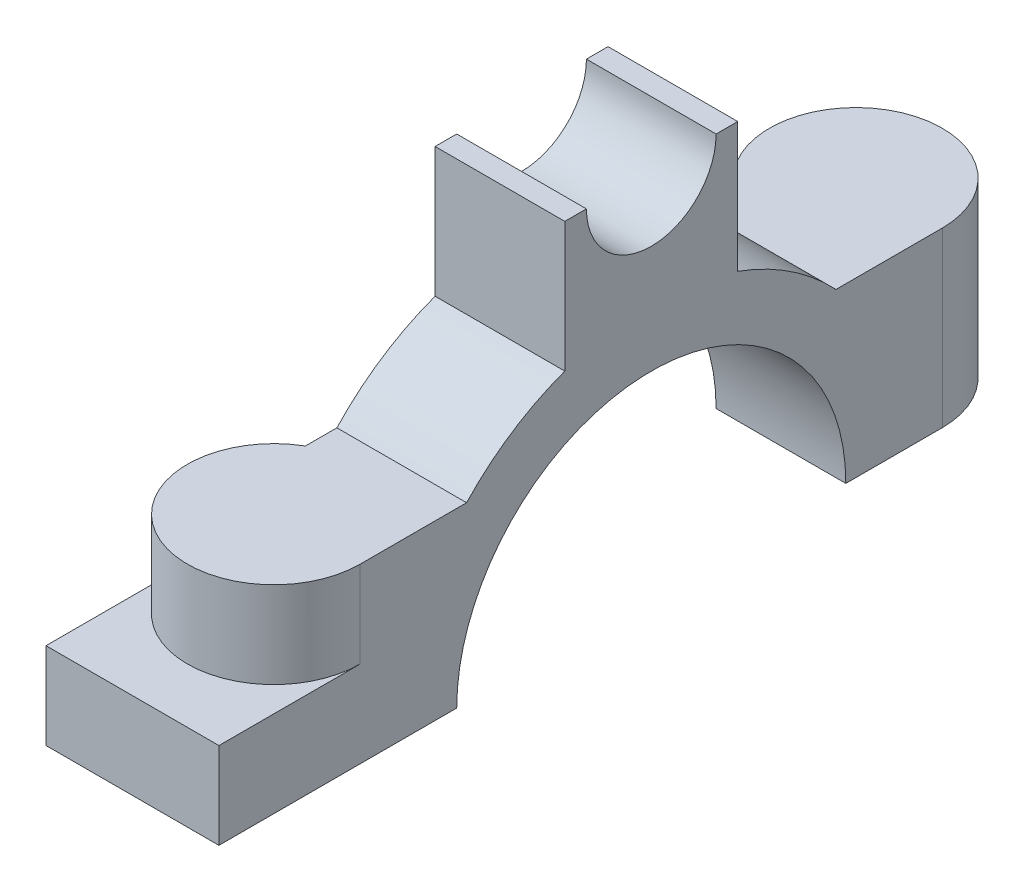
ISO-10303-21;
HEADER;
FILE_DESCRIPTION(('STEP AP214'),'2;1');
FILE_NAME('part.step','',(''),(''),'','','');
FILE_SCHEMA(('AUTOMOTIVE_DESIGN { 1 0 10303 214 1 1 1 1 }'));
ENDSEC;
DATA;
#1=APPLICATION_CONTEXT('core data for automotive mechanical design processes');
#2=APPLICATION_PROTOCOL_DEFINITION('international standard','automotive_design',2000,#1);
#3=PRODUCT_CONTEXT('',#1,'mechanical');
#4=PRODUCT('Part','Part','',(#3));
#5=PRODUCT_RELATED_PRODUCT_CATEGORY('part','',(#4));
#6=PRODUCT_DEFINITION_FORMATION('','',#4);
#7=PRODUCT_DEFINITION_CONTEXT('part definition',#1,'design');
#8=PRODUCT_DEFINITION('design','',#6,#7);
#9=PRODUCT_DEFINITION_SHAPE('','',#8);
#10=(LENGTH_UNIT() NAMED_UNIT(*) SI_UNIT(.MILLI.,.METRE.));
#11=(NAMED_UNIT(*) PLANE_ANGLE_UNIT() SI_UNIT($,.RADIAN.));
#12=(NAMED_UNIT(*) SI_UNIT($,.STERADIAN.) SOLID_ANGLE_UNIT());
#13=UNCERTAINTY_MEASURE_WITH_UNIT(LENGTH_MEASURE(1.E-05),#10,'distance_accuracy_value','');
#14=(GEOMETRIC_REPRESENTATION_CONTEXT(3) GLOBAL_UNCERTAINTY_ASSIGNED_CONTEXT((#13)) GLOBAL_UNIT_ASSIGNED_CONTEXT((#10,
#11,#12)) REPRESENTATION_CONTEXT('',''));
#15=CARTESIAN_POINT('',(0.,0.,0.));
#16=DIRECTION('',(0.,0.,1.));
#17=DIRECTION('',(1.,0.,0.));
#18=AXIS2_PLACEMENT_3D('',#15,#16,#17);
#19=CARTESIAN_POINT('',(27.8051237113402,16.5,-1.51108209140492));
#20=DIRECTION('',(0.,-1.,0.));
#21=DIRECTION('',(0.,0.,-1.));
#22=AXIS2_PLACEMENT_3D('',#19,#20,#21);
#23=PLANE('',#22);
#24=DIRECTION('',(-1.,0.,0.));
#25=VECTOR('',#24,1.);
#26=CARTESIAN_POINT('',(27.8051237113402,16.5,-1.51108209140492));
#27=LINE('',#26,#25);
#28=CARTESIAN_POINT('',(-26.1958762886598,16.5,-1.51108209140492));
#29=VERTEX_POINT('',#28);
#30=CARTESIAN_POINT('',(-29.1958762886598,16.5,-1.51108209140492));
#31=VERTEX_POINT('',#30);
#32=EDGE_CURVE('E257',#29,#31,#27,.T.);
#33=ORIENTED_EDGE('',*,*,#32,.T.);
#34=DIRECTION('',(0.,0.,-1.));
#35=VECTOR('',#34,1.);
#36=CARTESIAN_POINT('',(-29.1958762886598,16.5,1.98891790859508));
#37=LINE('',#36,#35);
#38=CARTESIAN_POINT('',(-29.1958762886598,16.5,-1.01108209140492));
#39=VERTEX_POINT('',#38);
#40=EDGE_CURVE('E189',#31,#39,#37,.F.);
#41=ORIENTED_EDGE('',*,*,#40,.T.);
#42=DIRECTION('',(-1.,0.,0.));
#43=VECTOR('',#42,1.);
#44=CARTESIAN_POINT('',(27.8051237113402,16.5,-1.01108209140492));
#45=LINE('',#44,#43);
#46=CARTESIAN_POINT('',(-26.1958762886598,16.5,-1.01108209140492));
#47=VERTEX_POINT('',#46);
#48=EDGE_CURVE('E217',#39,#47,#45,.F.);
#49=ORIENTED_EDGE('',*,*,#48,.T.);
#50=DIRECTION('',(0.,0.,-1.));
#51=VECTOR('',#50,1.);
#52=CARTESIAN_POINT('',(-26.1958762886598,16.5,-1.51108209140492));
#53=LINE('',#52,#51);
#54=EDGE_CURVE('E208',#29,#47,#53,.F.);
#55=ORIENTED_EDGE('',*,*,#54,.F.);
#56=EDGE_LOOP('',(#33,#41,#49,#55));
#57=FACE_BOUND('',#56,.T.);
#58=ADVANCED_FACE('F17',(#57),#23,.F.);
#59=CARTESIAN_POINT('',(27.8051237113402,16.5,-5.01108209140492));
#60=DIRECTION('',(0.,-1.,0.));
#61=DIRECTION('',(0.,0.,-1.));
#62=AXIS2_PLACEMENT_3D('',#59,#60,#61);
#63=PLANE('',#62);
#64=DIRECTION('',(1.,0.,0.));
#65=VECTOR('',#64,1.);
#66=CARTESIAN_POINT('',(27.8051237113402,16.5,-5.01108209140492));
#67=LINE('',#66,#65);
#68=CARTESIAN_POINT('',(-26.1958762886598,16.5,-5.01108209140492));
#69=VERTEX_POINT('',#68);
#70=CARTESIAN_POINT('',(-29.1958762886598,16.5,-5.01108209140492));
#71=VERTEX_POINT('',#70);
#72=EDGE_CURVE('E204',#69,#71,#67,.F.);
#73=ORIENTED_EDGE('',*,*,#72,.T.);
#74=DIRECTION('',(0.,0.,-1.));
#75=VECTOR('',#74,1.);
#76=CARTESIAN_POINT('',(-29.1958762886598,16.5,1.98891790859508));
#77=LINE('',#76,#75);
#78=CARTESIAN_POINT('',(-29.1958762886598,16.5,-4.51108209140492));
#79=VERTEX_POINT('',#78);
#80=EDGE_CURVE('E191',#71,#79,#77,.F.);
#81=ORIENTED_EDGE('',*,*,#80,.T.);
#82=DIRECTION('',(-1.,0.,0.));
#83=VECTOR('',#82,1.);
#84=CARTESIAN_POINT('',(27.8051237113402,16.5,-4.51108209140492));
#85=LINE('',#84,#83);
#86=CARTESIAN_POINT('',(-26.1958762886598,16.5,-4.51108209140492));
#87=VERTEX_POINT('',#86);
#88=EDGE_CURVE('E256',#79,#87,#85,.F.);
#89=ORIENTED_EDGE('',*,*,#88,.T.);
#90=DIRECTION('',(0.,0.,-1.));
#91=VECTOR('',#90,1.);
#92=CARTESIAN_POINT('',(-26.1958762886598,16.5,-5.01108209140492));
#93=LINE('',#92,#91);
#94=EDGE_CURVE('E195',#69,#87,#93,.F.);
#95=ORIENTED_EDGE('',*,*,#94,.F.);
#96=EDGE_LOOP('',(#73,#81,#89,#95));
#97=FACE_BOUND('',#96,.T.);
#98=ADVANCED_FACE('F288',(#97),#63,.F.);
#99=CARTESIAN_POINT('',(-29.1958762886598,18.,1.98891790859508));
#100=DIRECTION('',(1.,0.,0.));
#101=DIRECTION('',(0.,0.,-1.));
#102=AXIS2_PLACEMENT_3D('',#99,#100,#101);
#103=PLANE('',#102);
#104=DIRECTION('',(0.,0.,1.));
#105=VECTOR('',#104,1.);
#106=CARTESIAN_POINT('',(-29.1958762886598,8.,0.));
#107=LINE('',#106,#105);
#108=CARTESIAN_POINT('',(-29.1958762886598,8.,-8.01108209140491));
#109=VERTEX_POINT('',#108);
#110=CARTESIAN_POINT('',(-29.1958762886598,8.,-7.51108209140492));
#111=VERTEX_POINT('',#110);
#112=EDGE_CURVE('E247',#109,#111,#107,.T.);
#113=ORIENTED_EDGE('',*,*,#112,.T.);
#114=CARTESIAN_POINT('',(-29.1958762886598,8.,-3.01108209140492));
#115=DIRECTION('',(1.,0.,0.));
#116=DIRECTION('',(0.,0.,-1.));
#117=AXIS2_PLACEMENT_3D('',#114,#115,#116);
#118=CIRCLE('',#117,4.5);
#119=CARTESIAN_POINT('',(-29.1958762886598,8.,1.48891790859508));
#120=VERTEX_POINT('',#119);
#121=EDGE_CURVE('E239',#111,#120,#118,.T.);
#122=ORIENTED_EDGE('',*,*,#121,.T.);
#123=DIRECTION('',(0.,0.,-1.));
#124=VECTOR('',#123,1.);
#125=CARTESIAN_POINT('',(-29.1958762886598,8.,1.98891790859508));
#126=LINE('',#125,#124);
#127=CARTESIAN_POINT('',(-29.1958762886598,8.,1.98891790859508));
#128=VERTEX_POINT('',#127);
#129=EDGE_CURVE('E187',#128,#120,#126,.T.);
#130=ORIENTED_EDGE('',*,*,#129,.F.);
#131=DIRECTION('',(0.,-1.,0.));
#132=VECTOR('',#131,1.);
#133=CARTESIAN_POINT('',(-29.1958762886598,18.,1.98891790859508));
#134=LINE('',#133,#132);
#135=CARTESIAN_POINT('',(-29.1958762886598,12.,1.98891790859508));
#136=VERTEX_POINT('',#135);
#137=EDGE_CURVE('E144',#136,#128,#134,.T.);
#138=ORIENTED_EDGE('',*,*,#137,.F.);
#139=DIRECTION('',(0.,0.,-1.));
#140=VECTOR('',#139,1.);
#141=CARTESIAN_POINT('',(-29.1958762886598,12.,1.26091978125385));
#142=LINE('',#141,#140);
#143=CARTESIAN_POINT('',(-29.1958762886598,12.,1.26091978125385));
#144=VERTEX_POINT('',#143);
#145=EDGE_CURVE('E158',#136,#144,#142,.T.);
#146=ORIENTED_EDGE('',*,*,#145,.T.);
#147=CARTESIAN_POINT('',(-29.1958762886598,8.,-3.01108209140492));
#148=DIRECTION('',(-1.,0.,0.));
#149=DIRECTION('',(0.,0.,1.));
#150=AXIS2_PLACEMENT_3D('',#147,#148,#149);
#151=CIRCLE('',#150,5.85234995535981);
#152=CARTESIAN_POINT('',(-29.1958762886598,13.5,-1.01108209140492));
#153=VERTEX_POINT('',#152);
#154=EDGE_CURVE('E166',#153,#144,#151,.F.);
#155=ORIENTED_EDGE('',*,*,#154,.F.);
#156=DIRECTION('',(0.,1.,0.));
#157=VECTOR('',#156,1.);
#158=CARTESIAN_POINT('',(-29.1958762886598,16.5,-1.01108209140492));
#159=LINE('',#158,#157);
#160=EDGE_CURVE('E214',#153,#39,#159,.T.);
#161=ORIENTED_EDGE('',*,*,#160,.T.);
#162=ORIENTED_EDGE('',*,*,#40,.F.);
#163=CARTESIAN_POINT('',(-29.1958762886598,16.5,-3.01108209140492));
#164=DIRECTION('',(-1.,0.,0.));
#165=DIRECTION('',(0.,0.,1.));
#166=AXIS2_PLACEMENT_3D('',#163,#164,#165);
#167=CIRCLE('',#166,1.5);
#168=EDGE_CURVE('E253',#31,#79,#167,.F.);
#169=ORIENTED_EDGE('',*,*,#168,.T.);
#170=ORIENTED_EDGE('',*,*,#80,.F.);
#171=DIRECTION('',(0.,1.,0.));
#172=VECTOR('',#171,1.);
#173=CARTESIAN_POINT('',(-29.1958762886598,13.5,-5.01108209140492));
#174=LINE('',#173,#172);
#175=CARTESIAN_POINT('',(-29.1958762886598,13.5,-5.01108209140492));
#176=VERTEX_POINT('',#175);
#177=EDGE_CURVE('E200',#71,#176,#174,.F.);
#178=ORIENTED_EDGE('',*,*,#177,.T.);
#179=CARTESIAN_POINT('',(-29.1958762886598,8.,-3.01108209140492));
#180=DIRECTION('',(-1.,0.,0.));
#181=DIRECTION('',(0.,0.,1.));
#182=AXIS2_PLACEMENT_3D('',#179,#180,#181);
#183=CIRCLE('',#182,5.85234995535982);
#184=CARTESIAN_POINT('',(-29.1958762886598,12.,-7.28308396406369));
#185=VERTEX_POINT('',#184);
#186=EDGE_CURVE('E203',#185,#176,#183,.F.);
#187=ORIENTED_EDGE('',*,*,#186,.F.);
#188=DIRECTION('',(0.,0.,-1.));
#189=VECTOR('',#188,1.);
#190=CARTESIAN_POINT('',(-29.1958762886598,12.,-11.7431328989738));
#191=LINE('',#190,#189);
#192=CARTESIAN_POINT('',(-29.1958762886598,12.,-8.01108209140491));
#193=VERTEX_POINT('',#192);
#194=EDGE_CURVE('E250',#185,#193,#191,.T.);
#195=ORIENTED_EDGE('',*,*,#194,.T.);
#196=DIRECTION('',(0.,1.,0.));
#197=VECTOR('',#196,1.);
#198=CARTESIAN_POINT('',(-29.1958762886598,18.,-8.01108209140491));
#199=LINE('',#198,#197);
#200=EDGE_CURVE('E153',#109,#193,#199,.T.);
#201=ORIENTED_EDGE('',*,*,#200,.F.);
#202=EDGE_LOOP('',(#113,#122,#130,#138,#146,#155,#161,#162,#169,#170,#178,#187,#195,#201));
#203=FACE_BOUND('',#202,.T.);
#204=ADVANCED_FACE('F353',(#203),#103,.F.);
#205=CARTESIAN_POINT('',(-30.1958762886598,10.,14.9889179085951));
#206=DIRECTION('',(1.,0.,0.));
#207=DIRECTION('',(0.,0.,-1.));
#208=AXIS2_PLACEMENT_3D('',#205,#206,#207);
#209=PLANE('',#208);
#210=DIRECTION('',(0.,0.,1.));
#211=VECTOR('',#210,1.);
#212=CARTESIAN_POINT('',(-30.1958762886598,8.,0.));
#213=LINE('',#212,#211);
#214=CARTESIAN_POINT('',(-30.1958762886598,8.,3.72096871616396));
#215=VERTEX_POINT('',#214);
#216=CARTESIAN_POINT('',(-30.1958762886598,8.,6.98891790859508));
#217=VERTEX_POINT('',#216);
#218=EDGE_CURVE('E242',#215,#217,#213,.T.);
#219=ORIENTED_EDGE('',*,*,#218,.T.);
#220=DIRECTION('',(0.,1.,0.));
#221=VECTOR('',#220,1.);
#222=CARTESIAN_POINT('',(-30.1958762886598,18.,6.98891790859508));
#223=LINE('',#222,#221);
#224=CARTESIAN_POINT('',(-30.1958762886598,10.,6.98891790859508));
#225=VERTEX_POINT('',#224);
#226=EDGE_CURVE('E149',#217,#225,#223,.T.);
#227=ORIENTED_EDGE('',*,*,#226,.T.);
#228=DIRECTION('',(0.,0.,1.));
#229=VECTOR('',#228,1.);
#230=CARTESIAN_POINT('',(-30.1958762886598,10.,14.9889179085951));
#231=LINE('',#230,#229);
#232=CARTESIAN_POINT('',(-30.1958762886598,10.,3.72096871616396));
#233=VERTEX_POINT('',#232);
#234=EDGE_CURVE('E147',#233,#225,#231,.T.);
#235=ORIENTED_EDGE('',*,*,#234,.F.);
#236=DIRECTION('',(0.,-1.,0.));
#237=VECTOR('',#236,1.);
#238=CARTESIAN_POINT('',(-30.1958762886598,18.,3.72096871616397));
#239=LINE('',#238,#237);
#240=EDGE_CURVE('E134',#215,#233,#239,.F.);
#241=ORIENTED_EDGE('',*,*,#240,.F.);
#242=EDGE_LOOP('',(#219,#227,#235,#241));
#243=FACE_BOUND('',#242,.T.);
#244=ADVANCED_FACE('F148',(#243),#209,.F.);
#245=CARTESIAN_POINT('',(-28.1958762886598,10.,14.9889179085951));
#246=DIRECTION('',(0.,1.,0.));
#247=DIRECTION('',(0.,0.,1.));
#248=AXIS2_PLACEMENT_3D('',#245,#246,#247);
#249=PLANE('',#248);
#250=DIRECTION('',(-1.,0.,0.));
#251=VECTOR('',#250,1.);
#252=CARTESIAN_POINT('',(-26.1958762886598,10.,6.98891790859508));
#253=LINE('',#252,#251);
#254=CARTESIAN_POINT('',(-26.1958762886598,10.,6.98891790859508));
#255=VERTEX_POINT('',#254);
#256=EDGE_CURVE('E179',#225,#255,#253,.F.);
#257=ORIENTED_EDGE('',*,*,#256,.T.);
#258=DIRECTION('',(0.,0.,1.));
#259=VECTOR('',#258,1.);
#260=CARTESIAN_POINT('',(-26.1958762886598,10.,6.98891790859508));
#261=LINE('',#260,#259);
#262=CARTESIAN_POINT('',(-26.1958762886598,10.,3.72096871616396));
#263=VERTEX_POINT('',#262);
#264=EDGE_CURVE('E157',#255,#263,#261,.F.);
#265=ORIENTED_EDGE('',*,*,#264,.T.);
#266=CARTESIAN_POINT('',(-28.1958762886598,10.,3.72096871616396));
#267=DIRECTION('',(0.,-1.,0.));
#268=DIRECTION('',(0.,0.,-1.));
#269=AXIS2_PLACEMENT_3D('',#266,#267,#268);
#270=CIRCLE('',#269,2.);
#271=EDGE_CURVE('E20',#233,#263,#270,.F.);
#272=ORIENTED_EDGE('',*,*,#271,.F.);
#273=ORIENTED_EDGE('',*,*,#234,.T.);
#274=EDGE_LOOP('',(#257,#265,#272,#273));
#275=FACE_BOUND('',#274,.T.);
#276=ADVANCED_FACE('F156',(#275),#249,.T.);
#277=CARTESIAN_POINT('',(-28.1958762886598,18.,3.72096871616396));
#278=DIRECTION('',(0.,-1.,0.));
#279=DIRECTION('',(0.,0.,-1.));
#280=AXIS2_PLACEMENT_3D('',#277,#278,#279);
#281=CYLINDRICAL_SURFACE('',#280,2.);
#282=DIRECTION('',(0.,1.,0.));
#283=VECTOR('',#282,1.);
#284=CARTESIAN_POINT('',(-26.1958762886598,18.,3.72096871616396));
#285=LINE('',#284,#283);
#286=CARTESIAN_POINT('',(-26.1958762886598,12.,3.72096871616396));
#287=VERTEX_POINT('',#286);
#288=EDGE_CURVE('E171',#263,#287,#285,.T.);
#289=ORIENTED_EDGE('',*,*,#288,.T.);
#290=CARTESIAN_POINT('',(-28.1958762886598,12.,3.72096871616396));
#291=DIRECTION('',(0.,-1.,0.));
#292=DIRECTION('',(0.,0.,-1.));
#293=AXIS2_PLACEMENT_3D('',#290,#291,#292);
#294=CIRCLE('',#293,2.);
#295=EDGE_CURVE('E160',#287,#136,#294,.T.);
#296=ORIENTED_EDGE('',*,*,#295,.T.);
#297=ORIENTED_EDGE('',*,*,#137,.T.);
#298=CARTESIAN_POINT('',(-28.1958762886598,8.,3.72096871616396));
#299=DIRECTION('',(0.,-1.,0.));
#300=DIRECTION('',(0.,0.,-1.));
#301=AXIS2_PLACEMENT_3D('',#298,#299,#300);
#302=CIRCLE('',#301,2.);
#303=EDGE_CURVE('E142',#128,#215,#302,.F.);
#304=ORIENTED_EDGE('',*,*,#303,.T.);
#305=ORIENTED_EDGE('',*,*,#240,.T.);
#306=ORIENTED_EDGE('',*,*,#271,.T.);
#307=EDGE_LOOP('',(#289,#296,#297,#304,#305,#306));
#308=FACE_BOUND('',#307,.T.);
#309=ADVANCED_FACE('F137',(#308),#281,.T.);
#310=CARTESIAN_POINT('',(27.8051237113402,12.,1.26091978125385));
#311=DIRECTION('',(0.,-1.,0.));
#312=DIRECTION('',(0.,0.,-1.));
#313=AXIS2_PLACEMENT_3D('',#310,#311,#312);
#314=PLANE('',#313);
#315=DIRECTION('',(0.,0.,1.));
#316=VECTOR('',#315,1.);
#317=CARTESIAN_POINT('',(-26.1958762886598,12.,6.98891790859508));
#318=LINE('',#317,#316);
#319=CARTESIAN_POINT('',(-26.1958762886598,12.,1.26091978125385));
#320=VERTEX_POINT('',#319);
#321=EDGE_CURVE('E173',#287,#320,#318,.F.);
#322=ORIENTED_EDGE('',*,*,#321,.T.);
#323=DIRECTION('',(-1.,0.,0.));
#324=VECTOR('',#323,1.);
#325=CARTESIAN_POINT('',(27.8051237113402,12.,1.26091978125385));
#326=LINE('',#325,#324);
#327=EDGE_CURVE('E169',#144,#320,#326,.F.);
#328=ORIENTED_EDGE('',*,*,#327,.F.);
#329=ORIENTED_EDGE('',*,*,#145,.F.);
#330=ORIENTED_EDGE('',*,*,#295,.F.);
#331=EDGE_LOOP('',(#322,#328,#329,#330));
#332=FACE_BOUND('',#331,.T.);
#333=ADVANCED_FACE('F360',(#332),#314,.F.);
#334=CARTESIAN_POINT('',(27.8051237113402,8.,-3.01108209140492));
#335=DIRECTION('',(-1.,0.,0.));
#336=DIRECTION('',(0.,0.,1.));
#337=AXIS2_PLACEMENT_3D('',#334,#335,#336);
#338=CYLINDRICAL_SURFACE('',#337,5.85234995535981);
#339=ORIENTED_EDGE('',*,*,#154,.T.);
#340=ORIENTED_EDGE('',*,*,#327,.T.);
#341=CARTESIAN_POINT('',(-26.1958762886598,8.,-3.01108209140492));
#342=DIRECTION('',(-1.,0.,0.));
#343=DIRECTION('',(0.,0.,1.));
#344=AXIS2_PLACEMENT_3D('',#341,#342,#343);
#345=CIRCLE('',#344,5.85234995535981);
#346=CARTESIAN_POINT('',(-26.1958762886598,13.5,-1.01108209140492));
#347=VERTEX_POINT('',#346);
#348=EDGE_CURVE('E234',#320,#347,#345,.T.);
#349=ORIENTED_EDGE('',*,*,#348,.T.);
#350=DIRECTION('',(-1.,0.,0.));
#351=VECTOR('',#350,1.);
#352=CARTESIAN_POINT('',(27.8051237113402,13.5,-1.01108209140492));
#353=LINE('',#352,#351);
#354=EDGE_CURVE('E218',#347,#153,#353,.T.);
#355=ORIENTED_EDGE('',*,*,#354,.T.);
#356=EDGE_LOOP('',(#339,#340,#349,#355));
#357=FACE_BOUND('',#356,.T.);
#358=ADVANCED_FACE('F358',(#357),#338,.T.);
#359=CARTESIAN_POINT('',(27.8051237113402,16.5,-1.01108209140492));
#360=DIRECTION('',(0.,0.,-1.));
#361=DIRECTION('',(-1.,0.,0.));
#362=AXIS2_PLACEMENT_3D('',#359,#360,#361);
#363=PLANE('',#362);
#364=ORIENTED_EDGE('',*,*,#48,.F.);
#365=ORIENTED_EDGE('',*,*,#160,.F.);
#366=ORIENTED_EDGE('',*,*,#354,.F.);
#367=DIRECTION('',(0.,1.,0.));
#368=VECTOR('',#367,1.);
#369=CARTESIAN_POINT('',(-26.1958762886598,18.,-1.01108209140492));
#370=LINE('',#369,#368);
#371=EDGE_CURVE('E233',#347,#47,#370,.T.);
#372=ORIENTED_EDGE('',*,*,#371,.T.);
#373=EDGE_LOOP('',(#364,#365,#366,#372));
#374=FACE_BOUND('',#373,.T.);
#375=ADVANCED_FACE('F356',(#374),#363,.F.);
#376=CARTESIAN_POINT('',(27.8051237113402,16.5,-3.01108209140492));
#377=DIRECTION('',(-1.,0.,0.));
#378=DIRECTION('',(0.,0.,1.));
#379=AXIS2_PLACEMENT_3D('',#376,#377,#378);
#380=CYLINDRICAL_SURFACE('',#379,1.5);
#381=ORIENTED_EDGE('',*,*,#88,.F.);
#382=ORIENTED_EDGE('',*,*,#168,.F.);
#383=ORIENTED_EDGE('',*,*,#32,.F.);
#384=CARTESIAN_POINT('',(-26.1958762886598,16.5,-3.01108209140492));
#385=DIRECTION('',(-1.,0.,0.));
#386=DIRECTION('',(0.,0.,1.));
#387=AXIS2_PLACEMENT_3D('',#384,#385,#386);
#388=CIRCLE('',#387,1.5);
#389=EDGE_CURVE('E230',#29,#87,#388,.F.);
#390=ORIENTED_EDGE('',*,*,#389,.T.);
#391=EDGE_LOOP('',(#381,#382,#383,#390));
#392=FACE_BOUND('',#391,.T.);
#393=ADVANCED_FACE('F276',(#392),#380,.F.);
#394=CARTESIAN_POINT('',(27.8051237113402,13.5,-5.01108209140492));
#395=DIRECTION('',(0.,0.,1.));
#396=DIRECTION('',(1.,0.,0.));
#397=AXIS2_PLACEMENT_3D('',#394,#395,#396);
#398=PLANE('',#397);
#399=DIRECTION('',(-1.,0.,0.));
#400=VECTOR('',#399,1.);
#401=CARTESIAN_POINT('',(27.8051237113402,13.5,-5.01108209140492));
#402=LINE('',#401,#400);
#403=CARTESIAN_POINT('',(-26.1958762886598,13.5,-5.01108209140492));
#404=VERTEX_POINT('',#403);
#405=EDGE_CURVE('E252',#176,#404,#402,.F.);
#406=ORIENTED_EDGE('',*,*,#405,.F.);
#407=ORIENTED_EDGE('',*,*,#177,.F.);
#408=ORIENTED_EDGE('',*,*,#72,.F.);
#409=DIRECTION('',(0.,1.,0.));
#410=VECTOR('',#409,1.);
#411=CARTESIAN_POINT('',(-26.1958762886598,18.,-5.01108209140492));
#412=LINE('',#411,#410);
#413=EDGE_CURVE('E229',#69,#404,#412,.F.);
#414=ORIENTED_EDGE('',*,*,#413,.T.);
#415=EDGE_LOOP('',(#406,#407,#408,#414));
#416=FACE_BOUND('',#415,.T.);
#417=ADVANCED_FACE('F352',(#416),#398,.F.);
#418=CARTESIAN_POINT('',(27.8051237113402,8.,-3.01108209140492));
#419=DIRECTION('',(-1.,0.,0.));
#420=DIRECTION('',(0.,0.,1.));
#421=AXIS2_PLACEMENT_3D('',#418,#419,#420);
#422=CYLINDRICAL_SURFACE('',#421,5.85234995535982);
#423=ORIENTED_EDGE('',*,*,#186,.T.);
#424=ORIENTED_EDGE('',*,*,#405,.T.);
#425=CARTESIAN_POINT('',(-26.1958762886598,8.,-3.01108209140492));
#426=DIRECTION('',(-1.,0.,0.));
#427=DIRECTION('',(0.,0.,1.));
#428=AXIS2_PLACEMENT_3D('',#425,#426,#427);
#429=CIRCLE('',#428,5.85234995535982);
#430=CARTESIAN_POINT('',(-26.1958762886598,12.,-7.28308396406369));
#431=VERTEX_POINT('',#430);
#432=EDGE_CURVE('E225',#404,#431,#429,.T.);
#433=ORIENTED_EDGE('',*,*,#432,.T.);
#434=DIRECTION('',(1.,0.,0.));
#435=VECTOR('',#434,1.);
#436=CARTESIAN_POINT('',(27.8051237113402,12.,-7.28308396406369));
#437=LINE('',#436,#435);
#438=EDGE_CURVE('E294',#431,#185,#437,.F.);
#439=ORIENTED_EDGE('',*,*,#438,.T.);
#440=EDGE_LOOP('',(#423,#424,#433,#439));
#441=FACE_BOUND('',#440,.T.);
#442=ADVANCED_FACE('F348',(#441),#422,.T.);
#443=CARTESIAN_POINT('',(27.8051237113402,12.,-11.7431328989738));
#444=DIRECTION('',(0.,-1.,0.));
#445=DIRECTION('',(0.,0.,-1.));
#446=AXIS2_PLACEMENT_3D('',#443,#444,#445);
#447=PLANE('',#446);
#448=CARTESIAN_POINT('',(-28.1958762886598,12.,-9.74313289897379));
#449=DIRECTION('',(0.,-1.,0.));
#450=DIRECTION('',(0.,0.,-1.));
#451=AXIS2_PLACEMENT_3D('',#448,#449,#450);
#452=CIRCLE('',#451,2.);
#453=CARTESIAN_POINT('',(-26.1958762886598,12.,-9.74313289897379));
#454=VERTEX_POINT('',#453);
#455=EDGE_CURVE('E248',#193,#454,#452,.T.);
#456=ORIENTED_EDGE('',*,*,#455,.F.);
#457=ORIENTED_EDGE('',*,*,#194,.F.);
#458=ORIENTED_EDGE('',*,*,#438,.F.);
#459=DIRECTION('',(0.,0.,1.));
#460=VECTOR('',#459,1.);
#461=CARTESIAN_POINT('',(-26.1958762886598,12.,6.98891790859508));
#462=LINE('',#461,#460);
#463=EDGE_CURVE('E228',#431,#454,#462,.F.);
#464=ORIENTED_EDGE('',*,*,#463,.T.);
#465=EDGE_LOOP('',(#456,#457,#458,#464));
#466=FACE_BOUND('',#465,.T.);
#467=ADVANCED_FACE('F346',(#466),#447,.F.);
#468=CARTESIAN_POINT('',(-28.1958762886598,18.,-9.74313289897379));
#469=DIRECTION('',(0.,-1.,0.));
#470=DIRECTION('',(0.,0.,-1.));
#471=AXIS2_PLACEMENT_3D('',#468,#469,#470);
#472=CYLINDRICAL_SURFACE('',#471,2.);
#473=DIRECTION('',(0.,1.,0.));
#474=VECTOR('',#473,1.);
#475=CARTESIAN_POINT('',(-26.1958762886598,18.,-9.74313289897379));
#476=LINE('',#475,#474);
#477=CARTESIAN_POINT('',(-26.1958762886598,8.,-9.74313289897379));
#478=VERTEX_POINT('',#477);
#479=EDGE_CURVE('E299',#454,#478,#476,.F.);
#480=ORIENTED_EDGE('',*,*,#479,.T.);
#481=CARTESIAN_POINT('',(-28.1958762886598,8.,-9.74313289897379));
#482=DIRECTION('',(0.,-1.,0.));
#483=DIRECTION('',(0.,0.,-1.));
#484=AXIS2_PLACEMENT_3D('',#481,#482,#483);
#485=CIRCLE('',#484,2.);
#486=EDGE_CURVE('E244',#478,#109,#485,.F.);
#487=ORIENTED_EDGE('',*,*,#486,.T.);
#488=ORIENTED_EDGE('',*,*,#200,.T.);
#489=ORIENTED_EDGE('',*,*,#455,.T.);
#490=EDGE_LOOP('',(#480,#487,#488,#489));
#491=FACE_BOUND('',#490,.T.);
#492=ADVANCED_FACE('F343',(#491),#472,.T.);
#493=CARTESIAN_POINT('',(0.,8.,0.));
#494=DIRECTION('',(0.,1.,0.));
#495=DIRECTION('',(0.,0.,1.));
#496=AXIS2_PLACEMENT_3D('',#493,#494,#495);
#497=PLANE('',#496);
#498=ORIENTED_EDGE('',*,*,#112,.F.);
#499=ORIENTED_EDGE('',*,*,#486,.F.);
#500=DIRECTION('',(0.,0.,1.));
#501=VECTOR('',#500,1.);
#502=CARTESIAN_POINT('',(-26.1958762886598,8.,6.98891790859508));
#503=LINE('',#502,#501);
#504=CARTESIAN_POINT('',(-26.1958762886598,8.,-7.51108209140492));
#505=VERTEX_POINT('',#504);
#506=EDGE_CURVE('E224',#478,#505,#503,.T.);
#507=ORIENTED_EDGE('',*,*,#506,.T.);
#508=DIRECTION('',(1.,0.,0.));
#509=VECTOR('',#508,1.);
#510=CARTESIAN_POINT('',(-30.1968762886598,8.,-7.51108209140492));
#511=LINE('',#510,#509);
#512=EDGE_CURVE('E243',#505,#111,#511,.F.);
#513=ORIENTED_EDGE('',*,*,#512,.T.);
#514=EDGE_LOOP('',(#498,#499,#507,#513));
#515=FACE_BOUND('',#514,.T.);
#516=ADVANCED_FACE('F339',(#515),#497,.F.);
#517=CARTESIAN_POINT('',(-30.1968762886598,8.,-3.01108209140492));
#518=DIRECTION('',(1.,0.,0.));
#519=DIRECTION('',(0.,0.,-1.));
#520=AXIS2_PLACEMENT_3D('',#517,#518,#519);
#521=CYLINDRICAL_SURFACE('',#520,4.5);
#522=DIRECTION('',(1.,0.,0.));
#523=VECTOR('',#522,1.);
#524=CARTESIAN_POINT('',(0.,8.,1.48891790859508));
#525=LINE('',#524,#523);
#526=CARTESIAN_POINT('',(-26.1958762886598,8.,1.48891790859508));
#527=VERTEX_POINT('',#526);
#528=EDGE_CURVE('E238',#527,#120,#525,.F.);
#529=ORIENTED_EDGE('',*,*,#528,.T.);
#530=ORIENTED_EDGE('',*,*,#121,.F.);
#531=ORIENTED_EDGE('',*,*,#512,.F.);
#532=CARTESIAN_POINT('',(-26.1958762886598,8.,-3.01108209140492));
#533=DIRECTION('',(1.,0.,0.));
#534=DIRECTION('',(0.,0.,-1.));
#535=AXIS2_PLACEMENT_3D('',#532,#533,#534);
#536=CIRCLE('',#535,4.5);
#537=EDGE_CURVE('E221',#505,#527,#536,.T.);
#538=ORIENTED_EDGE('',*,*,#537,.T.);
#539=EDGE_LOOP('',(#529,#530,#531,#538));
#540=FACE_BOUND('',#539,.T.);
#541=ADVANCED_FACE('F335',(#540),#521,.F.);
#542=CARTESIAN_POINT('',(0.,8.,0.));
#543=DIRECTION('',(0.,1.,0.));
#544=DIRECTION('',(0.,0.,1.));
#545=AXIS2_PLACEMENT_3D('',#542,#543,#544);
#546=PLANE('',#545);
#547=ORIENTED_EDGE('',*,*,#129,.T.);
#548=ORIENTED_EDGE('',*,*,#528,.F.);
#549=DIRECTION('',(0.,0.,1.));
#550=VECTOR('',#549,1.);
#551=CARTESIAN_POINT('',(-26.1958762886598,8.,6.98891790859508));
#552=LINE('',#551,#550);
#553=CARTESIAN_POINT('',(-26.1958762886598,8.,6.98891790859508));
#554=VERTEX_POINT('',#553);
#555=EDGE_CURVE('E26',#527,#554,#552,.T.);
#556=ORIENTED_EDGE('',*,*,#555,.T.);
#557=DIRECTION('',(-1.,0.,0.));
#558=VECTOR('',#557,1.);
#559=CARTESIAN_POINT('',(-26.1958762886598,8.,6.98891790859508));
#560=LINE('',#559,#558);
#561=EDGE_CURVE('E34',#554,#217,#560,.T.);
#562=ORIENTED_EDGE('',*,*,#561,.T.);
#563=ORIENTED_EDGE('',*,*,#218,.F.);
#564=ORIENTED_EDGE('',*,*,#303,.F.);
#565=EDGE_LOOP('',(#547,#548,#556,#562,#563,#564));
#566=FACE_BOUND('',#565,.T.);
#567=ADVANCED_FACE('F331',(#566),#546,.F.);
#568=CARTESIAN_POINT('',(-26.1958762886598,18.,6.98891790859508));
#569=DIRECTION('',(0.,0.,-1.));
#570=DIRECTION('',(-1.,0.,0.));
#571=AXIS2_PLACEMENT_3D('',#568,#569,#570);
#572=PLANE('',#571);
#573=ORIENTED_EDGE('',*,*,#561,.F.);
#574=DIRECTION('',(0.,1.,0.));
#575=VECTOR('',#574,1.);
#576=CARTESIAN_POINT('',(-26.1958762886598,18.,6.98891790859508));
#577=LINE('',#576,#575);
#578=EDGE_CURVE('E11',#554,#255,#577,.T.);
#579=ORIENTED_EDGE('',*,*,#578,.T.);
#580=ORIENTED_EDGE('',*,*,#256,.F.);
#581=ORIENTED_EDGE('',*,*,#226,.F.);
#582=EDGE_LOOP('',(#573,#579,#580,#581));
#583=FACE_BOUND('',#582,.T.);
#584=ADVANCED_FACE('F371',(#583),#572,.F.);
#585=CARTESIAN_POINT('',(-26.1958762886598,18.,6.98891790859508));
#586=DIRECTION('',(-1.,0.,0.));
#587=DIRECTION('',(0.,0.,1.));
#588=AXIS2_PLACEMENT_3D('',#585,#586,#587);
#589=PLANE('',#588);
#590=ORIENTED_EDGE('',*,*,#555,.F.);
#591=ORIENTED_EDGE('',*,*,#537,.F.);
#592=ORIENTED_EDGE('',*,*,#506,.F.);
#593=ORIENTED_EDGE('',*,*,#479,.F.);
#594=ORIENTED_EDGE('',*,*,#463,.F.);
#595=ORIENTED_EDGE('',*,*,#432,.F.);
#596=ORIENTED_EDGE('',*,*,#413,.F.);
#597=ORIENTED_EDGE('',*,*,#94,.T.);
#598=ORIENTED_EDGE('',*,*,#389,.F.);
#599=ORIENTED_EDGE('',*,*,#54,.T.);
#600=ORIENTED_EDGE('',*,*,#371,.F.);
#601=ORIENTED_EDGE('',*,*,#348,.F.);
#602=ORIENTED_EDGE('',*,*,#321,.F.);
#603=ORIENTED_EDGE('',*,*,#288,.F.);
#604=ORIENTED_EDGE('',*,*,#264,.F.);
#605=ORIENTED_EDGE('',*,*,#578,.F.);
#606=EDGE_LOOP('',(#590,#591,#592,#593,#594,#595,#596,#597,#598,#599,#600,#601,#602,#603,#604,#605));
#607=FACE_BOUND('',#606,.T.);
#608=ADVANCED_FACE('F279',(#607),#589,.F.);
#609=CLOSED_SHELL('',(#58,#98,#204,#244,#276,#309,#333,#358,#375,#393,#417,#442,#467,#492,#516,
#541,#567,#584,#608));
#610=MANIFOLD_SOLID_BREP('B1',#609);
#611=ADVANCED_BREP_SHAPE_REPRESENTATION('',(#18,#610),#14);
#612=SHAPE_DEFINITION_REPRESENTATION(#9,#611);
ENDSEC;
END-ISO-10303-21;
